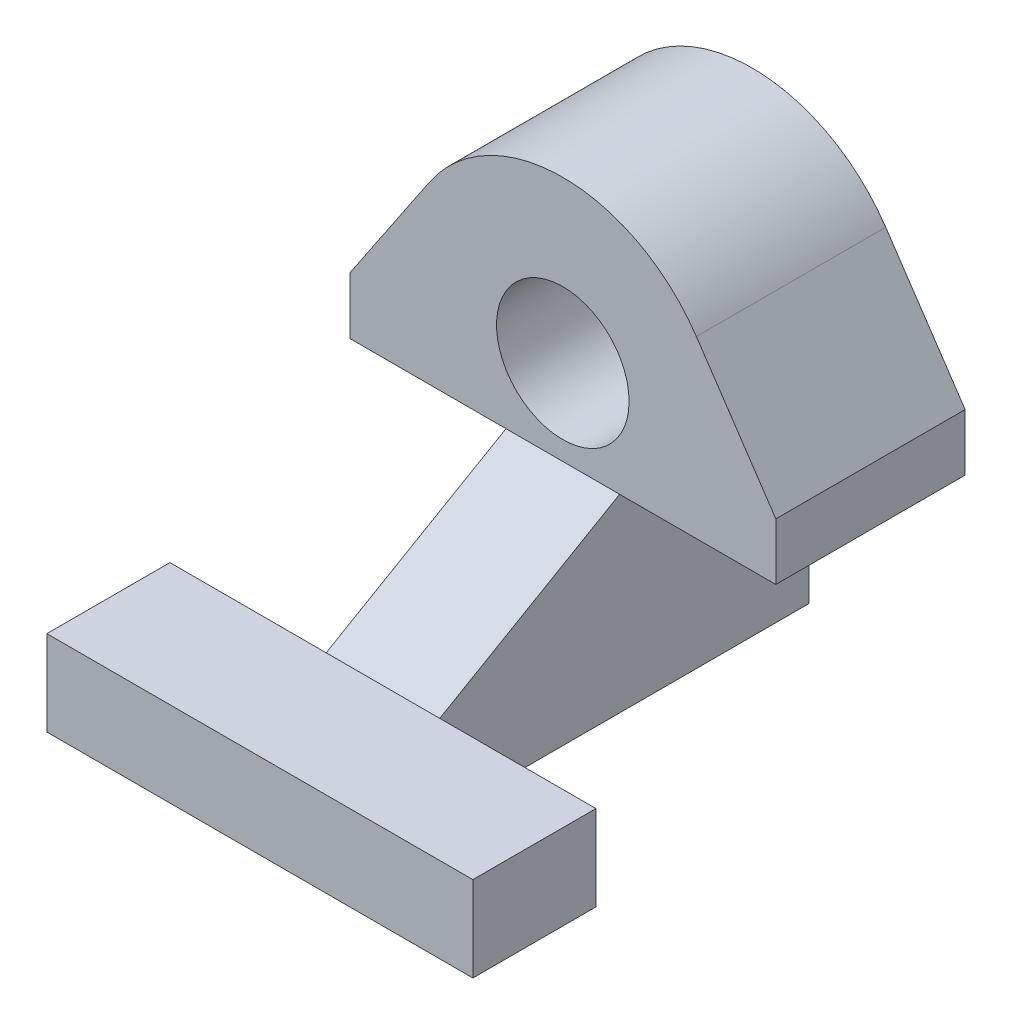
ISO-10303-21;
HEADER;
FILE_DESCRIPTION(('STEP AP214'),'2;1');
FILE_NAME('part.step','',(''),(''),'','','');
FILE_SCHEMA(('AUTOMOTIVE_DESIGN { 1 0 10303 214 1 1 1 1 }'));
ENDSEC;
DATA;
#1=APPLICATION_CONTEXT('core data for automotive mechanical design processes');
#2=APPLICATION_PROTOCOL_DEFINITION('international standard','automotive_design',2000,#1);
#3=PRODUCT_CONTEXT('',#1,'mechanical');
#4=PRODUCT('Part','Part','',(#3));
#5=PRODUCT_RELATED_PRODUCT_CATEGORY('part','',(#4));
#6=PRODUCT_DEFINITION_FORMATION('','',#4);
#7=PRODUCT_DEFINITION_CONTEXT('part definition',#1,'design');
#8=PRODUCT_DEFINITION('design','',#6,#7);
#9=PRODUCT_DEFINITION_SHAPE('','',#8);
#10=(LENGTH_UNIT() NAMED_UNIT(*) SI_UNIT(.MILLI.,.METRE.));
#11=(NAMED_UNIT(*) PLANE_ANGLE_UNIT() SI_UNIT($,.RADIAN.));
#12=(NAMED_UNIT(*) SI_UNIT($,.STERADIAN.) SOLID_ANGLE_UNIT());
#13=UNCERTAINTY_MEASURE_WITH_UNIT(LENGTH_MEASURE(1.E-05),#10,'distance_accuracy_value','');
#14=(GEOMETRIC_REPRESENTATION_CONTEXT(3) GLOBAL_UNCERTAINTY_ASSIGNED_CONTEXT((#13)) GLOBAL_UNIT_ASSIGNED_CONTEXT((#10,
#11,#12)) REPRESENTATION_CONTEXT('',''));
#15=CARTESIAN_POINT('',(0.,0.,0.));
#16=DIRECTION('',(0.,0.,1.));
#17=DIRECTION('',(1.,0.,0.));
#18=AXIS2_PLACEMENT_3D('',#15,#16,#17);
#19=CARTESIAN_POINT('',(-22.5,-9.,20.));
#20=DIRECTION('',(0.,1.,0.));
#21=DIRECTION('',(-1.,0.,0.));
#22=AXIS2_PLACEMENT_3D('',#19,#20,#21);
#23=PLANE('',#22);
#24=DIRECTION('',(0.,0.,1.));
#25=VECTOR('',#24,1.);
#26=CARTESIAN_POINT('',(6.,-8.99999999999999,20.));
#27=LINE('',#26,#25);
#28=CARTESIAN_POINT('',(5.99999999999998,-9.,0.));
#29=VERTEX_POINT('',#28);
#30=CARTESIAN_POINT('',(6.,-8.99999999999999,20.));
#31=VERTEX_POINT('',#30);
#32=EDGE_CURVE('E56',#29,#31,#27,.T.);
#33=ORIENTED_EDGE('',*,*,#32,.F.);
#34=DIRECTION('',(1.,0.,0.));
#35=VECTOR('',#34,1.);
#36=CARTESIAN_POINT('',(-22.5,-9.,0.));
#37=LINE('',#36,#35);
#38=CARTESIAN_POINT('',(22.5,-8.99999999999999,0.));
#39=VERTEX_POINT('',#38);
#40=EDGE_CURVE('E282',#29,#39,#37,.T.);
#41=ORIENTED_EDGE('',*,*,#40,.T.);
#42=DIRECTION('',(0.,0.,-1.));
#43=VECTOR('',#42,1.);
#44=CARTESIAN_POINT('',(22.5,-8.99999999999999,20.));
#45=LINE('',#44,#43);
#46=CARTESIAN_POINT('',(22.5,-8.99999999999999,20.));
#47=VERTEX_POINT('',#46);
#48=EDGE_CURVE('E40',#47,#39,#45,.T.);
#49=ORIENTED_EDGE('',*,*,#48,.F.);
#50=DIRECTION('',(1.,0.,0.));
#51=VECTOR('',#50,1.);
#52=CARTESIAN_POINT('',(-22.5,-9.,20.));
#53=LINE('',#52,#51);
#54=EDGE_CURVE('E271',#31,#47,#53,.T.);
#55=ORIENTED_EDGE('',*,*,#54,.F.);
#56=EDGE_LOOP('',(#33,#41,#49,#55));
#57=FACE_BOUND('',#56,.T.);
#58=ADVANCED_FACE('F31',(#57),#23,.F.);
#59=CARTESIAN_POINT('',(0.,0.,20.));
#60=DIRECTION('',(0.,0.,1.));
#61=DIRECTION('',(1.,0.,0.));
#62=AXIS2_PLACEMENT_3D('',#59,#60,#61);
#63=PLANE('',#62);
#64=DIRECTION('',(0.,-1.,0.));
#65=VECTOR('',#64,1.);
#66=CARTESIAN_POINT('',(-22.5,-9.,20.));
#67=LINE('',#66,#65);
#68=CARTESIAN_POINT('',(-22.5,-2.99999999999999,20.));
#69=VERTEX_POINT('',#68);
#70=CARTESIAN_POINT('',(-22.5,-9.,20.));
#71=VERTEX_POINT('',#70);
#72=EDGE_CURVE('E268',#69,#71,#67,.T.);
#73=ORIENTED_EDGE('',*,*,#72,.T.);
#74=CARTESIAN_POINT('',(-6.00000000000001,-9.,20.));
#75=VERTEX_POINT('',#74);
#76=EDGE_CURVE('E280',#71,#75,#53,.T.);
#77=ORIENTED_EDGE('',*,*,#76,.T.);
#78=DIRECTION('',(-1.,0.,0.));
#79=VECTOR('',#78,1.);
#80=CARTESIAN_POINT('',(6.,-8.99999999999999,20.));
#81=LINE('',#80,#79);
#82=EDGE_CURVE('E250',#31,#75,#81,.T.);
#83=ORIENTED_EDGE('',*,*,#82,.F.);
#84=ORIENTED_EDGE('',*,*,#54,.T.);
#85=DIRECTION('',(0.,1.,0.));
#86=VECTOR('',#85,1.);
#87=CARTESIAN_POINT('',(22.5,-8.99999999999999,20.));
#88=LINE('',#87,#86);
#89=CARTESIAN_POINT('',(22.5,-2.99999999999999,20.));
#90=VERTEX_POINT('',#89);
#91=EDGE_CURVE('E275',#47,#90,#88,.T.);
#92=ORIENTED_EDGE('',*,*,#91,.T.);
#93=DIRECTION('',(-0.55785774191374,0.829936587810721,0.));
#94=VECTOR('',#93,1.);
#95=CARTESIAN_POINT('',(22.5,-2.99999999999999,20.));
#96=LINE('',#95,#94);
#97=CARTESIAN_POINT('',(14.1089219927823,9.48358161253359,20.));
#98=VERTEX_POINT('',#97);
#99=EDGE_CURVE('E335',#90,#98,#96,.T.);
#100=ORIENTED_EDGE('',*,*,#99,.T.);
#101=CARTESIAN_POINT('',(0.,0.,20.));
#102=DIRECTION('',(0.,0.,1.));
#103=DIRECTION('',(1.,0.,0.));
#104=AXIS2_PLACEMENT_3D('',#101,#102,#103);
#105=CIRCLE('',#104,17.);
#106=CARTESIAN_POINT('',(-14.1089219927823,9.48358161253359,20.));
#107=VERTEX_POINT('',#106);
#108=EDGE_CURVE('E332',#98,#107,#105,.T.);
#109=ORIENTED_EDGE('',*,*,#108,.T.);
#110=DIRECTION('',(-0.55785774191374,-0.829936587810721,0.));
#111=VECTOR('',#110,1.);
#112=CARTESIAN_POINT('',(-22.5,-2.99999999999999,20.));
#113=LINE('',#112,#111);
#114=EDGE_CURVE('E302',#107,#69,#113,.T.);
#115=ORIENTED_EDGE('',*,*,#114,.T.);
#116=EDGE_LOOP('',(#73,#77,#83,#84,#92,#100,#109,#115));
#117=FACE_BOUND('',#116,.T.);
#118=CARTESIAN_POINT('',(0.,0.,20.));
#119=DIRECTION('',(0.,0.,1.));
#120=DIRECTION('',(1.,0.,0.));
#121=AXIS2_PLACEMENT_3D('',#118,#119,#120);
#122=CIRCLE('',#121,7.);
#123=CARTESIAN_POINT('',(7.,0.,20.));
#124=VERTEX_POINT('',#123);
#125=EDGE_CURVE('E262',#124,#124,#122,.T.);
#126=ORIENTED_EDGE('',*,*,#125,.F.);
#127=EDGE_LOOP('',(#126));
#128=FACE_BOUND('',#127,.T.);
#129=ADVANCED_FACE('F337',(#117,#128),#63,.T.);
#130=CARTESIAN_POINT('',(0.,0.,0.));
#131=DIRECTION('',(0.,0.,1.));
#132=DIRECTION('',(1.,0.,0.));
#133=AXIS2_PLACEMENT_3D('',#130,#131,#132);
#134=PLANE('',#133);
#135=DIRECTION('',(0.,-1.,0.));
#136=VECTOR('',#135,1.);
#137=CARTESIAN_POINT('',(-22.5,-9.,0.));
#138=LINE('',#137,#136);
#139=CARTESIAN_POINT('',(-22.5,-2.99999999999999,0.));
#140=VERTEX_POINT('',#139);
#141=CARTESIAN_POINT('',(-22.5,-9.,0.));
#142=VERTEX_POINT('',#141);
#143=EDGE_CURVE('E265',#140,#142,#138,.T.);
#144=ORIENTED_EDGE('',*,*,#143,.F.);
#145=DIRECTION('',(-0.55785774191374,-0.829936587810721,0.));
#146=VECTOR('',#145,1.);
#147=CARTESIAN_POINT('',(-22.5,-2.99999999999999,0.));
#148=LINE('',#147,#146);
#149=CARTESIAN_POINT('',(-14.1089219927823,9.48358161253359,0.));
#150=VERTEX_POINT('',#149);
#151=EDGE_CURVE('E272',#150,#140,#148,.T.);
#152=ORIENTED_EDGE('',*,*,#151,.F.);
#153=CARTESIAN_POINT('',(0.,0.,0.));
#154=DIRECTION('',(0.,0.,1.));
#155=DIRECTION('',(1.,0.,0.));
#156=AXIS2_PLACEMENT_3D('',#153,#154,#155);
#157=CIRCLE('',#156,17.);
#158=CARTESIAN_POINT('',(14.1089219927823,9.48358161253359,0.));
#159=VERTEX_POINT('',#158);
#160=EDGE_CURVE('E295',#159,#150,#157,.T.);
#161=ORIENTED_EDGE('',*,*,#160,.F.);
#162=DIRECTION('',(-0.55785774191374,0.829936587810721,0.));
#163=VECTOR('',#162,1.);
#164=CARTESIAN_POINT('',(22.5,-2.99999999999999,0.));
#165=LINE('',#164,#163);
#166=CARTESIAN_POINT('',(22.5,-2.99999999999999,0.));
#167=VERTEX_POINT('',#166);
#168=EDGE_CURVE('E293',#167,#159,#165,.T.);
#169=ORIENTED_EDGE('',*,*,#168,.F.);
#170=DIRECTION('',(0.,1.,0.));
#171=VECTOR('',#170,1.);
#172=CARTESIAN_POINT('',(22.5,-8.99999999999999,0.));
#173=LINE('',#172,#171);
#174=EDGE_CURVE('E290',#39,#167,#173,.T.);
#175=ORIENTED_EDGE('',*,*,#174,.F.);
#176=ORIENTED_EDGE('',*,*,#40,.F.);
#177=DIRECTION('',(0.,1.,0.));
#178=VECTOR('',#177,1.);
#179=CARTESIAN_POINT('',(6.,-8.99999999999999,0.));
#180=LINE('',#179,#178);
#181=CARTESIAN_POINT('',(6.,-29.,0.));
#182=VERTEX_POINT('',#181);
#183=EDGE_CURVE('E217',#182,#29,#180,.T.);
#184=ORIENTED_EDGE('',*,*,#183,.F.);
#185=DIRECTION('',(-1.,0.,0.));
#186=VECTOR('',#185,1.);
#187=CARTESIAN_POINT('',(6.,-29.,0.));
#188=LINE('',#187,#186);
#189=CARTESIAN_POINT('',(-6.,-29.,0.));
#190=VERTEX_POINT('',#189);
#191=EDGE_CURVE('E251',#182,#190,#188,.T.);
#192=ORIENTED_EDGE('',*,*,#191,.T.);
#193=DIRECTION('',(0.,1.,0.));
#194=VECTOR('',#193,1.);
#195=CARTESIAN_POINT('',(-6.,-8.99999999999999,0.));
#196=LINE('',#195,#194);
#197=CARTESIAN_POINT('',(-6.00000000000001,-9.,0.));
#198=VERTEX_POINT('',#197);
#199=EDGE_CURVE('E245',#190,#198,#196,.T.);
#200=ORIENTED_EDGE('',*,*,#199,.T.);
#201=EDGE_CURVE('E285',#142,#198,#37,.T.);
#202=ORIENTED_EDGE('',*,*,#201,.F.);
#203=EDGE_LOOP('',(#144,#152,#161,#169,#175,#176,#184,#192,#200,#202));
#204=FACE_BOUND('',#203,.T.);
#205=CARTESIAN_POINT('',(0.,0.,0.));
#206=DIRECTION('',(0.,0.,1.));
#207=DIRECTION('',(1.,0.,0.));
#208=AXIS2_PLACEMENT_3D('',#205,#206,#207);
#209=CIRCLE('',#208,7.);
#210=CARTESIAN_POINT('',(7.,0.,0.));
#211=VERTEX_POINT('',#210);
#212=EDGE_CURVE('E253',#211,#211,#209,.T.);
#213=ORIENTED_EDGE('',*,*,#212,.T.);
#214=EDGE_LOOP('',(#213));
#215=FACE_BOUND('',#214,.T.);
#216=ADVANCED_FACE('F320',(#204,#215),#134,.F.);
#217=CARTESIAN_POINT('',(-22.5,-9.,20.));
#218=DIRECTION('',(1.,0.,0.));
#219=DIRECTION('',(0.,0.,-1.));
#220=AXIS2_PLACEMENT_3D('',#217,#218,#219);
#221=PLANE('',#220);
#222=ORIENTED_EDGE('',*,*,#143,.T.);
#223=DIRECTION('',(0.,0.,-1.));
#224=VECTOR('',#223,1.);
#225=CARTESIAN_POINT('',(-22.5,-9.,20.));
#226=LINE('',#225,#224);
#227=EDGE_CURVE('E11',#71,#142,#226,.T.);
#228=ORIENTED_EDGE('',*,*,#227,.F.);
#229=ORIENTED_EDGE('',*,*,#72,.F.);
#230=DIRECTION('',(0.,0.,-1.));
#231=VECTOR('',#230,1.);
#232=CARTESIAN_POINT('',(-22.5,-2.99999999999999,20.));
#233=LINE('',#232,#231);
#234=EDGE_CURVE('E298',#69,#140,#233,.T.);
#235=ORIENTED_EDGE('',*,*,#234,.T.);
#236=EDGE_LOOP('',(#222,#228,#229,#235));
#237=FACE_BOUND('',#236,.T.);
#238=ADVANCED_FACE('F33',(#237),#221,.F.);
#239=ORIENTED_EDGE('',*,*,#201,.T.);
#240=DIRECTION('',(0.,0.,1.));
#241=VECTOR('',#240,1.);
#242=CARTESIAN_POINT('',(-6.,-8.99999999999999,20.));
#243=LINE('',#242,#241);
#244=EDGE_CURVE('E48',#198,#75,#243,.T.);
#245=ORIENTED_EDGE('',*,*,#244,.T.);
#246=ORIENTED_EDGE('',*,*,#76,.F.);
#247=ORIENTED_EDGE('',*,*,#227,.T.);
#248=EDGE_LOOP('',(#239,#245,#246,#247));
#249=FACE_BOUND('',#248,.T.);
#250=ADVANCED_FACE('F361',(#249),#23,.F.);
#251=CARTESIAN_POINT('',(22.5,-8.99999999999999,20.));
#252=DIRECTION('',(-1.,0.,0.));
#253=DIRECTION('',(0.,0.,1.));
#254=AXIS2_PLACEMENT_3D('',#251,#252,#253);
#255=PLANE('',#254);
#256=ORIENTED_EDGE('',*,*,#174,.T.);
#257=DIRECTION('',(0.,0.,-1.));
#258=VECTOR('',#257,1.);
#259=CARTESIAN_POINT('',(22.5,-2.99999999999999,20.));
#260=LINE('',#259,#258);
#261=EDGE_CURVE('E308',#90,#167,#260,.T.);
#262=ORIENTED_EDGE('',*,*,#261,.F.);
#263=ORIENTED_EDGE('',*,*,#91,.F.);
#264=ORIENTED_EDGE('',*,*,#48,.T.);
#265=EDGE_LOOP('',(#256,#262,#263,#264));
#266=FACE_BOUND('',#265,.T.);
#267=ADVANCED_FACE('F316',(#266),#255,.F.);
#268=CARTESIAN_POINT('',(22.5,-2.99999999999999,20.));
#269=DIRECTION('',(-0.829936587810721,-0.55785774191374,0.));
#270=DIRECTION('',(0.55785774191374,-0.829936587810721,0.));
#271=AXIS2_PLACEMENT_3D('',#268,#269,#270);
#272=PLANE('',#271);
#273=ORIENTED_EDGE('',*,*,#168,.T.);
#274=DIRECTION('',(0.,0.,-1.));
#275=VECTOR('',#274,1.);
#276=CARTESIAN_POINT('',(14.1089219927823,9.48358161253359,20.));
#277=LINE('',#276,#275);
#278=EDGE_CURVE('E305',#98,#159,#277,.T.);
#279=ORIENTED_EDGE('',*,*,#278,.F.);
#280=ORIENTED_EDGE('',*,*,#99,.F.);
#281=ORIENTED_EDGE('',*,*,#261,.T.);
#282=EDGE_LOOP('',(#273,#279,#280,#281));
#283=FACE_BOUND('',#282,.T.);
#284=ADVANCED_FACE('F326',(#283),#272,.F.);
#285=CARTESIAN_POINT('',(0.,0.,20.));
#286=DIRECTION('',(0.,0.,-1.));
#287=DIRECTION('',(-1.,0.,0.));
#288=AXIS2_PLACEMENT_3D('',#285,#286,#287);
#289=CYLINDRICAL_SURFACE('',#288,17.);
#290=ORIENTED_EDGE('',*,*,#160,.T.);
#291=DIRECTION('',(0.,0.,-1.));
#292=VECTOR('',#291,1.);
#293=CARTESIAN_POINT('',(-14.1089219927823,9.48358161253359,20.));
#294=LINE('',#293,#292);
#295=EDGE_CURVE('E301',#107,#150,#294,.T.);
#296=ORIENTED_EDGE('',*,*,#295,.F.);
#297=ORIENTED_EDGE('',*,*,#108,.F.);
#298=ORIENTED_EDGE('',*,*,#278,.T.);
#299=EDGE_LOOP('',(#290,#296,#297,#298));
#300=FACE_BOUND('',#299,.T.);
#301=ADVANCED_FACE('F330',(#300),#289,.T.);
#302=CARTESIAN_POINT('',(-22.5,-2.99999999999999,20.));
#303=DIRECTION('',(0.829936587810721,-0.55785774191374,0.));
#304=DIRECTION('',(0.55785774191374,0.829936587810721,0.));
#305=AXIS2_PLACEMENT_3D('',#302,#303,#304);
#306=PLANE('',#305);
#307=ORIENTED_EDGE('',*,*,#151,.T.);
#308=ORIENTED_EDGE('',*,*,#234,.F.);
#309=ORIENTED_EDGE('',*,*,#114,.F.);
#310=ORIENTED_EDGE('',*,*,#295,.T.);
#311=EDGE_LOOP('',(#307,#308,#309,#310));
#312=FACE_BOUND('',#311,.T.);
#313=ADVANCED_FACE('F378',(#312),#306,.F.);
#314=CARTESIAN_POINT('',(0.,0.,20.));
#315=DIRECTION('',(0.,0.,-1.));
#316=DIRECTION('',(-1.,0.,0.));
#317=AXIS2_PLACEMENT_3D('',#314,#315,#316);
#318=CYLINDRICAL_SURFACE('',#317,7.);
#319=ORIENTED_EDGE('',*,*,#125,.T.);
#320=EDGE_LOOP('',(#319));
#321=FACE_BOUND('',#320,.T.);
#322=ORIENTED_EDGE('',*,*,#212,.F.);
#323=EDGE_LOOP('',(#322));
#324=FACE_BOUND('',#323,.T.);
#325=ADVANCED_FACE('F380',(#321,#324),#318,.F.);
#326=CARTESIAN_POINT('',(6.,-20.,39.));
#327=DIRECTION('',(0.,-0.865426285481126,-0.501036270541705));
#328=DIRECTION('',(0.,0.501036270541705,-0.865426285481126));
#329=AXIS2_PLACEMENT_3D('',#326,#327,#328);
#330=PLANE('',#329);
#331=DIRECTION('',(0.,-0.501036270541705,0.865426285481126));
#332=VECTOR('',#331,1.);
#333=CARTESIAN_POINT('',(-6.,-20.,39.));
#334=LINE('',#333,#332);
#335=CARTESIAN_POINT('',(-5.99999999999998,-20.,39.));
#336=VERTEX_POINT('',#335);
#337=EDGE_CURVE('E168',#75,#336,#334,.T.);
#338=ORIENTED_EDGE('',*,*,#337,.T.);
#339=DIRECTION('',(-1.,0.,0.));
#340=VECTOR('',#339,1.);
#341=CARTESIAN_POINT('',(6.,-20.,39.));
#342=LINE('',#341,#340);
#343=CARTESIAN_POINT('',(6.00000000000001,-20.,39.));
#344=VERTEX_POINT('',#343);
#345=EDGE_CURVE('E249',#344,#336,#342,.T.);
#346=ORIENTED_EDGE('',*,*,#345,.F.);
#347=DIRECTION('',(0.,-0.501036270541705,0.865426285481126));
#348=VECTOR('',#347,1.);
#349=CARTESIAN_POINT('',(6.,-20.,39.));
#350=LINE('',#349,#348);
#351=EDGE_CURVE('E214',#31,#344,#350,.T.);
#352=ORIENTED_EDGE('',*,*,#351,.F.);
#353=ORIENTED_EDGE('',*,*,#82,.T.);
#354=EDGE_LOOP('',(#338,#346,#352,#353));
#355=FACE_BOUND('',#354,.T.);
#356=ADVANCED_FACE('F339',(#355),#330,.F.);
#357=CARTESIAN_POINT('',(6.,-29.,0.));
#358=DIRECTION('',(0.,1.,0.));
#359=DIRECTION('',(0.,0.,1.));
#360=AXIS2_PLACEMENT_3D('',#357,#358,#359);
#361=PLANE('',#360);
#362=DIRECTION('',(0.,0.,-1.));
#363=VECTOR('',#362,1.);
#364=CARTESIAN_POINT('',(-6.,-29.,0.));
#365=LINE('',#364,#363);
#366=CARTESIAN_POINT('',(-5.99999999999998,-29.,39.));
#367=VERTEX_POINT('',#366);
#368=EDGE_CURVE('E241',#367,#190,#365,.T.);
#369=ORIENTED_EDGE('',*,*,#368,.T.);
#370=ORIENTED_EDGE('',*,*,#191,.F.);
#371=DIRECTION('',(0.,0.,-1.));
#372=VECTOR('',#371,1.);
#373=CARTESIAN_POINT('',(6.,-29.,0.));
#374=LINE('',#373,#372);
#375=CARTESIAN_POINT('',(6.,-29.,39.));
#376=VERTEX_POINT('',#375);
#377=EDGE_CURVE('E209',#376,#182,#374,.T.);
#378=ORIENTED_EDGE('',*,*,#377,.F.);
#379=DIRECTION('',(-1.,0.,0.));
#380=VECTOR('',#379,1.);
#381=CARTESIAN_POINT('',(22.5,-29.,39.));
#382=LINE('',#381,#380);
#383=CARTESIAN_POINT('',(22.5,-29.,39.));
#384=VERTEX_POINT('',#383);
#385=EDGE_CURVE('E175',#384,#376,#382,.T.);
#386=ORIENTED_EDGE('',*,*,#385,.F.);
#387=DIRECTION('',(0.,0.,-1.));
#388=VECTOR('',#387,1.);
#389=CARTESIAN_POINT('',(22.5,-29.,39.));
#390=LINE('',#389,#388);
#391=CARTESIAN_POINT('',(22.5,-29.,52.));
#392=VERTEX_POINT('',#391);
#393=EDGE_CURVE('E158',#392,#384,#390,.T.);
#394=ORIENTED_EDGE('',*,*,#393,.F.);
#395=DIRECTION('',(-1.,0.,0.));
#396=VECTOR('',#395,1.);
#397=CARTESIAN_POINT('',(22.5,-29.,52.));
#398=LINE('',#397,#396);
#399=CARTESIAN_POINT('',(-22.5,-29.,52.));
#400=VERTEX_POINT('',#399);
#401=EDGE_CURVE('E178',#392,#400,#398,.T.);
#402=ORIENTED_EDGE('',*,*,#401,.T.);
#403=DIRECTION('',(0.,0.,-1.));
#404=VECTOR('',#403,1.);
#405=CARTESIAN_POINT('',(-22.5,-29.,39.));
#406=LINE('',#405,#404);
#407=CARTESIAN_POINT('',(-22.5,-29.,39.));
#408=VERTEX_POINT('',#407);
#409=EDGE_CURVE('E161',#400,#408,#406,.T.);
#410=ORIENTED_EDGE('',*,*,#409,.T.);
#411=EDGE_CURVE('E179',#367,#408,#382,.T.);
#412=ORIENTED_EDGE('',*,*,#411,.F.);
#413=EDGE_LOOP('',(#369,#370,#378,#386,#394,#402,#410,#412));
#414=FACE_BOUND('',#413,.T.);
#415=ADVANCED_FACE('F206',(#414),#361,.F.);
#416=CARTESIAN_POINT('',(6.,-8.99999999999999,39.));
#417=DIRECTION('',(1.,0.,0.));
#418=DIRECTION('',(0.,0.,-1.));
#419=AXIS2_PLACEMENT_3D('',#416,#417,#418);
#420=PLANE('',#419);
#421=ORIENTED_EDGE('',*,*,#32,.T.);
#422=ORIENTED_EDGE('',*,*,#351,.T.);
#423=DIRECTION('',(0.,-1.,0.));
#424=VECTOR('',#423,1.);
#425=CARTESIAN_POINT('',(6.,-29.,39.));
#426=LINE('',#425,#424);
#427=EDGE_CURVE('E165',#344,#376,#426,.T.);
#428=ORIENTED_EDGE('',*,*,#427,.T.);
#429=ORIENTED_EDGE('',*,*,#377,.T.);
#430=ORIENTED_EDGE('',*,*,#183,.T.);
#431=EDGE_LOOP('',(#421,#422,#428,#429,#430));
#432=FACE_BOUND('',#431,.T.);
#433=ADVANCED_FACE('F211',(#432),#420,.T.);
#434=CARTESIAN_POINT('',(-6.,-8.99999999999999,39.));
#435=DIRECTION('',(1.,0.,0.));
#436=DIRECTION('',(0.,0.,-1.));
#437=AXIS2_PLACEMENT_3D('',#434,#435,#436);
#438=PLANE('',#437);
#439=ORIENTED_EDGE('',*,*,#244,.F.);
#440=ORIENTED_EDGE('',*,*,#199,.F.);
#441=ORIENTED_EDGE('',*,*,#368,.F.);
#442=DIRECTION('',(0.,-1.,0.));
#443=VECTOR('',#442,1.);
#444=CARTESIAN_POINT('',(-6.,-29.,39.));
#445=LINE('',#444,#443);
#446=EDGE_CURVE('E236',#336,#367,#445,.T.);
#447=ORIENTED_EDGE('',*,*,#446,.F.);
#448=ORIENTED_EDGE('',*,*,#337,.F.);
#449=EDGE_LOOP('',(#439,#440,#441,#447,#448));
#450=FACE_BOUND('',#449,.T.);
#451=ADVANCED_FACE('F349',(#450),#438,.F.);
#452=CARTESIAN_POINT('',(22.5,-20.,39.));
#453=DIRECTION('',(0.,0.,1.));
#454=DIRECTION('',(1.,0.,0.));
#455=AXIS2_PLACEMENT_3D('',#452,#453,#454);
#456=PLANE('',#455);
#457=DIRECTION('',(-1.,0.,0.));
#458=VECTOR('',#457,1.);
#459=CARTESIAN_POINT('',(22.5,-20.,39.));
#460=LINE('',#459,#458);
#461=CARTESIAN_POINT('',(-22.5,-20.,39.));
#462=VERTEX_POINT('',#461);
#463=EDGE_CURVE('E166',#336,#462,#460,.T.);
#464=ORIENTED_EDGE('',*,*,#463,.F.);
#465=ORIENTED_EDGE('',*,*,#446,.T.);
#466=ORIENTED_EDGE('',*,*,#411,.T.);
#467=DIRECTION('',(0.,1.,0.));
#468=VECTOR('',#467,1.);
#469=CARTESIAN_POINT('',(-22.5,-20.,39.));
#470=LINE('',#469,#468);
#471=EDGE_CURVE('E200',#408,#462,#470,.T.);
#472=ORIENTED_EDGE('',*,*,#471,.T.);
#473=EDGE_LOOP('',(#464,#465,#466,#472));
#474=FACE_BOUND('',#473,.T.);
#475=ADVANCED_FACE('F350',(#474),#456,.F.);
#476=ORIENTED_EDGE('',*,*,#427,.F.);
#477=CARTESIAN_POINT('',(22.5,-20.,39.));
#478=VERTEX_POINT('',#477);
#479=EDGE_CURVE('E146',#478,#344,#460,.T.);
#480=ORIENTED_EDGE('',*,*,#479,.F.);
#481=DIRECTION('',(0.,1.,0.));
#482=VECTOR('',#481,1.);
#483=CARTESIAN_POINT('',(22.5,-20.,39.));
#484=LINE('',#483,#482);
#485=EDGE_CURVE('E153',#384,#478,#484,.T.);
#486=ORIENTED_EDGE('',*,*,#485,.F.);
#487=ORIENTED_EDGE('',*,*,#385,.T.);
#488=EDGE_LOOP('',(#476,#480,#486,#487));
#489=FACE_BOUND('',#488,.T.);
#490=ADVANCED_FACE('F163',(#489),#456,.F.);
#491=CARTESIAN_POINT('',(22.5,-20.,39.));
#492=DIRECTION('',(0.,-1.,0.));
#493=DIRECTION('',(0.,0.,-1.));
#494=AXIS2_PLACEMENT_3D('',#491,#492,#493);
#495=PLANE('',#494);
#496=DIRECTION('',(0.,0.,1.));
#497=VECTOR('',#496,1.);
#498=CARTESIAN_POINT('',(-22.5,-20.,39.));
#499=LINE('',#498,#497);
#500=CARTESIAN_POINT('',(-22.5,-20.,52.));
#501=VERTEX_POINT('',#500);
#502=EDGE_CURVE('E197',#462,#501,#499,.T.);
#503=ORIENTED_EDGE('',*,*,#502,.T.);
#504=DIRECTION('',(-1.,0.,0.));
#505=VECTOR('',#504,1.);
#506=CARTESIAN_POINT('',(22.5,-20.,52.));
#507=LINE('',#506,#505);
#508=CARTESIAN_POINT('',(22.5,-20.,52.));
#509=VERTEX_POINT('',#508);
#510=EDGE_CURVE('E149',#509,#501,#507,.T.);
#511=ORIENTED_EDGE('',*,*,#510,.F.);
#512=DIRECTION('',(0.,0.,1.));
#513=VECTOR('',#512,1.);
#514=CARTESIAN_POINT('',(22.5,-20.,39.));
#515=LINE('',#514,#513);
#516=EDGE_CURVE('E141',#478,#509,#515,.T.);
#517=ORIENTED_EDGE('',*,*,#516,.F.);
#518=ORIENTED_EDGE('',*,*,#479,.T.);
#519=ORIENTED_EDGE('',*,*,#345,.T.);
#520=ORIENTED_EDGE('',*,*,#463,.T.);
#521=EDGE_LOOP('',(#503,#511,#517,#518,#519,#520));
#522=FACE_BOUND('',#521,.T.);
#523=ADVANCED_FACE('F143',(#522),#495,.F.);
#524=CARTESIAN_POINT('',(22.5,-20.,52.));
#525=DIRECTION('',(0.,0.,-1.));
#526=DIRECTION('',(0.,1.,0.));
#527=AXIS2_PLACEMENT_3D('',#524,#525,#526);
#528=PLANE('',#527);
#529=DIRECTION('',(0.,-1.,0.));
#530=VECTOR('',#529,1.);
#531=CARTESIAN_POINT('',(-22.5,-20.,52.));
#532=LINE('',#531,#530);
#533=EDGE_CURVE('E191',#501,#400,#532,.T.);
#534=ORIENTED_EDGE('',*,*,#533,.T.);
#535=ORIENTED_EDGE('',*,*,#401,.F.);
#536=DIRECTION('',(0.,-1.,0.));
#537=VECTOR('',#536,1.);
#538=CARTESIAN_POINT('',(22.5,-20.,52.));
#539=LINE('',#538,#537);
#540=EDGE_CURVE('E152',#509,#392,#539,.T.);
#541=ORIENTED_EDGE('',*,*,#540,.F.);
#542=ORIENTED_EDGE('',*,*,#510,.T.);
#543=EDGE_LOOP('',(#534,#535,#541,#542));
#544=FACE_BOUND('',#543,.T.);
#545=ADVANCED_FACE('F189',(#544),#528,.F.);
#546=CARTESIAN_POINT('',(22.5,-29.,39.));
#547=DIRECTION('',(-1.,0.,0.));
#548=DIRECTION('',(0.,0.,1.));
#549=AXIS2_PLACEMENT_3D('',#546,#547,#548);
#550=PLANE('',#549);
#551=ORIENTED_EDGE('',*,*,#485,.T.);
#552=ORIENTED_EDGE('',*,*,#516,.T.);
#553=ORIENTED_EDGE('',*,*,#540,.T.);
#554=ORIENTED_EDGE('',*,*,#393,.T.);
#555=EDGE_LOOP('',(#551,#552,#553,#554));
#556=FACE_BOUND('',#555,.T.);
#557=ADVANCED_FACE('F156',(#556),#550,.F.);
#558=CARTESIAN_POINT('',(-22.5,-29.,39.));
#559=DIRECTION('',(-1.,0.,0.));
#560=DIRECTION('',(0.,0.,1.));
#561=AXIS2_PLACEMENT_3D('',#558,#559,#560);
#562=PLANE('',#561);
#563=ORIENTED_EDGE('',*,*,#471,.F.);
#564=ORIENTED_EDGE('',*,*,#409,.F.);
#565=ORIENTED_EDGE('',*,*,#533,.F.);
#566=ORIENTED_EDGE('',*,*,#502,.F.);
#567=EDGE_LOOP('',(#563,#564,#565,#566));
#568=FACE_BOUND('',#567,.T.);
#569=ADVANCED_FACE('F196',(#568),#562,.T.);
#570=CLOSED_SHELL('',(#58,#129,#216,#238,#250,#267,#284,#301,#313,#325,#356,#415,#433,#451,#475,
#490,#523,#545,#557,#569));
#571=MANIFOLD_SOLID_BREP('B2',#570);
#572=ADVANCED_BREP_SHAPE_REPRESENTATION('',(#18,#571),#14);
#573=SHAPE_DEFINITION_REPRESENTATION(#9,#572);
ENDSEC;
END-ISO-10303-21;
